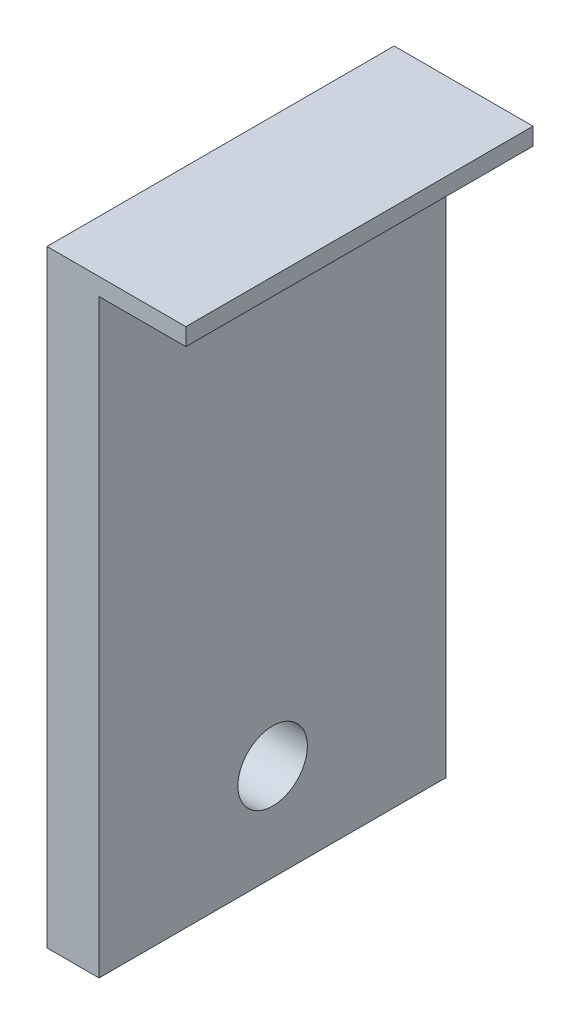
ISO-10303-21;
HEADER;
FILE_DESCRIPTION(('STEP AP214'),'2;1');
FILE_NAME('part.step','',(''),(''),'','','');
FILE_SCHEMA(('AUTOMOTIVE_DESIGN { 1 0 10303 214 1 1 1 1 }'));
ENDSEC;
DATA;
#1=APPLICATION_CONTEXT('core data for automotive mechanical design processes');
#2=APPLICATION_PROTOCOL_DEFINITION('international standard','automotive_design',2000,#1);
#3=PRODUCT_CONTEXT('',#1,'mechanical');
#4=PRODUCT('Part','Part','',(#3));
#5=PRODUCT_RELATED_PRODUCT_CATEGORY('part','',(#4));
#6=PRODUCT_DEFINITION_FORMATION('','',#4);
#7=PRODUCT_DEFINITION_CONTEXT('part definition',#1,'design');
#8=PRODUCT_DEFINITION('design','',#6,#7);
#9=PRODUCT_DEFINITION_SHAPE('','',#8);
#10=(LENGTH_UNIT() NAMED_UNIT(*) SI_UNIT(.MILLI.,.METRE.));
#11=(NAMED_UNIT(*) PLANE_ANGLE_UNIT() SI_UNIT($,.RADIAN.));
#12=(NAMED_UNIT(*) SI_UNIT($,.STERADIAN.) SOLID_ANGLE_UNIT());
#13=UNCERTAINTY_MEASURE_WITH_UNIT(LENGTH_MEASURE(1.E-05),#10,'distance_accuracy_value','');
#14=(GEOMETRIC_REPRESENTATION_CONTEXT(3) GLOBAL_UNCERTAINTY_ASSIGNED_CONTEXT((#13)) GLOBAL_UNIT_ASSIGNED_CONTEXT((#10,
#11,#12)) REPRESENTATION_CONTEXT('',''));
#15=CARTESIAN_POINT('',(0.,0.,0.));
#16=DIRECTION('',(0.,0.,1.));
#17=DIRECTION('',(1.,0.,0.));
#18=AXIS2_PLACEMENT_3D('',#15,#16,#17);
#19=CARTESIAN_POINT('',(3.,35.,0.));
#20=DIRECTION('',(-1.,0.,0.));
#21=DIRECTION('',(0.,0.,1.));
#22=AXIS2_PLACEMENT_3D('',#19,#20,#21);
#23=PLANE('',#22);
#24=CARTESIAN_POINT('',(3.,5.57985377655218,-10.));
#25=DIRECTION('',(-1.,0.,0.));
#26=DIRECTION('',(0.,0.,1.));
#27=AXIS2_PLACEMENT_3D('',#24,#25,#26);
#28=CIRCLE('',#27,2.);
#29=CARTESIAN_POINT('',(3.,5.57985377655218,-8.));
#30=VERTEX_POINT('',#29);
#31=EDGE_CURVE('E126',#30,#30,#28,.T.);
#32=ORIENTED_EDGE('',*,*,#31,.T.);
#33=EDGE_LOOP('',(#32));
#34=FACE_BOUND('',#33,.T.);
#35=DIRECTION('',(0.,0.,-1.));
#36=VECTOR('',#35,1.);
#37=CARTESIAN_POINT('',(3.,34.,0.));
#38=LINE('',#37,#36);
#39=CARTESIAN_POINT('',(3.,34.,0.));
#40=VERTEX_POINT('',#39);
#41=CARTESIAN_POINT('',(3.,34.,-20.));
#42=VERTEX_POINT('',#41);
#43=EDGE_CURVE('E52',#40,#42,#38,.T.);
#44=ORIENTED_EDGE('',*,*,#43,.F.);
#45=DIRECTION('',(0.,-1.,0.));
#46=VECTOR('',#45,1.);
#47=CARTESIAN_POINT('',(3.,35.,0.));
#48=LINE('',#47,#46);
#49=CARTESIAN_POINT('',(3.,0.,0.));
#50=VERTEX_POINT('',#49);
#51=EDGE_CURVE('E45',#40,#50,#48,.T.);
#52=ORIENTED_EDGE('',*,*,#51,.T.);
#53=DIRECTION('',(0.,0.,-1.));
#54=VECTOR('',#53,1.);
#55=CARTESIAN_POINT('',(3.,0.,0.));
#56=LINE('',#55,#54);
#57=CARTESIAN_POINT('',(3.,0.,-20.));
#58=VERTEX_POINT('',#57);
#59=EDGE_CURVE('E91',#50,#58,#56,.T.);
#60=ORIENTED_EDGE('',*,*,#59,.T.);
#61=DIRECTION('',(0.,-1.,0.));
#62=VECTOR('',#61,1.);
#63=CARTESIAN_POINT('',(3.,35.,-20.));
#64=LINE('',#63,#62);
#65=EDGE_CURVE('E85',#42,#58,#64,.T.);
#66=ORIENTED_EDGE('',*,*,#65,.F.);
#67=EDGE_LOOP('',(#44,#52,#60,#66));
#68=FACE_BOUND('',#67,.T.);
#69=ADVANCED_FACE('F37',(#34,#68),#23,.F.);
#70=CARTESIAN_POINT('',(0.,35.,0.));
#71=DIRECTION('',(1.,0.,0.));
#72=DIRECTION('',(0.,0.,-1.));
#73=AXIS2_PLACEMENT_3D('',#70,#71,#72);
#74=PLANE('',#73);
#75=CARTESIAN_POINT('',(0.,5.57985377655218,-10.));
#76=DIRECTION('',(-1.,0.,0.));
#77=DIRECTION('',(0.,0.,1.));
#78=AXIS2_PLACEMENT_3D('',#75,#76,#77);
#79=CIRCLE('',#78,2.);
#80=CARTESIAN_POINT('',(0.,5.57985377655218,-8.));
#81=VERTEX_POINT('',#80);
#82=EDGE_CURVE('E137',#81,#81,#79,.T.);
#83=ORIENTED_EDGE('',*,*,#82,.F.);
#84=EDGE_LOOP('',(#83));
#85=FACE_BOUND('',#84,.T.);
#86=DIRECTION('',(0.,0.,1.));
#87=VECTOR('',#86,1.);
#88=CARTESIAN_POINT('',(0.,0.,0.));
#89=LINE('',#88,#87);
#90=CARTESIAN_POINT('',(0.,0.,-20.));
#91=VERTEX_POINT('',#90);
#92=CARTESIAN_POINT('',(0.,0.,0.));
#93=VERTEX_POINT('',#92);
#94=EDGE_CURVE('E96',#91,#93,#89,.T.);
#95=ORIENTED_EDGE('',*,*,#94,.T.);
#96=DIRECTION('',(0.,-1.,0.));
#97=VECTOR('',#96,1.);
#98=CARTESIAN_POINT('',(0.,35.,0.));
#99=LINE('',#98,#97);
#100=CARTESIAN_POINT('',(0.,35.,0.));
#101=VERTEX_POINT('',#100);
#102=EDGE_CURVE('E11',#101,#93,#99,.T.);
#103=ORIENTED_EDGE('',*,*,#102,.F.);
#104=DIRECTION('',(0.,0.,1.));
#105=VECTOR('',#104,1.);
#106=CARTESIAN_POINT('',(0.,35.,0.));
#107=LINE('',#106,#105);
#108=CARTESIAN_POINT('',(0.,35.,-20.));
#109=VERTEX_POINT('',#108);
#110=EDGE_CURVE('E90',#109,#101,#107,.T.);
#111=ORIENTED_EDGE('',*,*,#110,.F.);
#112=DIRECTION('',(0.,-1.,0.));
#113=VECTOR('',#112,1.);
#114=CARTESIAN_POINT('',(0.,35.,-20.));
#115=LINE('',#114,#113);
#116=EDGE_CURVE('E82',#109,#91,#115,.T.);
#117=ORIENTED_EDGE('',*,*,#116,.T.);
#118=EDGE_LOOP('',(#95,#103,#111,#117));
#119=FACE_BOUND('',#118,.T.);
#120=ADVANCED_FACE('F39',(#85,#119),#74,.F.);
#121=CARTESIAN_POINT('',(0.,35.,0.));
#122=DIRECTION('',(0.,0.,-1.));
#123=DIRECTION('',(-1.,0.,0.));
#124=AXIS2_PLACEMENT_3D('',#121,#122,#123);
#125=PLANE('',#124);
#126=DIRECTION('',(1.,0.,0.));
#127=VECTOR('',#126,1.);
#128=CARTESIAN_POINT('',(0.,0.,0.));
#129=LINE('',#128,#127);
#130=EDGE_CURVE('E100',#93,#50,#129,.T.);
#131=ORIENTED_EDGE('',*,*,#130,.T.);
#132=ORIENTED_EDGE('',*,*,#51,.F.);
#133=DIRECTION('',(-1.,0.,0.));
#134=VECTOR('',#133,1.);
#135=CARTESIAN_POINT('',(8.,34.,0.));
#136=LINE('',#135,#134);
#137=CARTESIAN_POINT('',(8.,34.,0.));
#138=VERTEX_POINT('',#137);
#139=EDGE_CURVE('E101',#138,#40,#136,.T.);
#140=ORIENTED_EDGE('',*,*,#139,.F.);
#141=DIRECTION('',(0.,-1.,0.));
#142=VECTOR('',#141,1.);
#143=CARTESIAN_POINT('',(8.,35.,0.));
#144=LINE('',#143,#142);
#145=CARTESIAN_POINT('',(8.,35.,0.));
#146=VERTEX_POINT('',#145);
#147=EDGE_CURVE('E118',#146,#138,#144,.T.);
#148=ORIENTED_EDGE('',*,*,#147,.F.);
#149=DIRECTION('',(1.,0.,0.));
#150=VECTOR('',#149,1.);
#151=CARTESIAN_POINT('',(0.,35.,0.));
#152=LINE('',#151,#150);
#153=EDGE_CURVE('E116',#101,#146,#152,.T.);
#154=ORIENTED_EDGE('',*,*,#153,.F.);
#155=ORIENTED_EDGE('',*,*,#102,.T.);
#156=EDGE_LOOP('',(#131,#132,#140,#148,#154,#155));
#157=FACE_BOUND('',#156,.T.);
#158=ADVANCED_FACE('F113',(#157),#125,.F.);
#159=CARTESIAN_POINT('',(0.,35.,-20.));
#160=DIRECTION('',(0.,0.,1.));
#161=DIRECTION('',(1.,0.,0.));
#162=AXIS2_PLACEMENT_3D('',#159,#160,#161);
#163=PLANE('',#162);
#164=DIRECTION('',(-1.,0.,0.));
#165=VECTOR('',#164,1.);
#166=CARTESIAN_POINT('',(0.,0.,-20.));
#167=LINE('',#166,#165);
#168=EDGE_CURVE('E79',#58,#91,#167,.T.);
#169=ORIENTED_EDGE('',*,*,#168,.T.);
#170=ORIENTED_EDGE('',*,*,#116,.F.);
#171=DIRECTION('',(-1.,0.,0.));
#172=VECTOR('',#171,1.);
#173=CARTESIAN_POINT('',(0.,35.,-20.));
#174=LINE('',#173,#172);
#175=CARTESIAN_POINT('',(8.,35.,-20.));
#176=VERTEX_POINT('',#175);
#177=EDGE_CURVE('E61',#176,#109,#174,.T.);
#178=ORIENTED_EDGE('',*,*,#177,.F.);
#179=DIRECTION('',(0.,1.,0.));
#180=VECTOR('',#179,1.);
#181=CARTESIAN_POINT('',(8.,35.,-20.));
#182=LINE('',#181,#180);
#183=CARTESIAN_POINT('',(8.,34.,-20.));
#184=VERTEX_POINT('',#183);
#185=EDGE_CURVE('E128',#184,#176,#182,.T.);
#186=ORIENTED_EDGE('',*,*,#185,.F.);
#187=DIRECTION('',(-1.,0.,0.));
#188=VECTOR('',#187,1.);
#189=CARTESIAN_POINT('',(8.,34.,-20.));
#190=LINE('',#189,#188);
#191=EDGE_CURVE('E105',#184,#42,#190,.T.);
#192=ORIENTED_EDGE('',*,*,#191,.T.);
#193=ORIENTED_EDGE('',*,*,#65,.T.);
#194=EDGE_LOOP('',(#169,#170,#178,#186,#192,#193));
#195=FACE_BOUND('',#194,.T.);
#196=ADVANCED_FACE('F81',(#195),#163,.F.);
#197=CARTESIAN_POINT('',(0.,35.,0.));
#198=DIRECTION('',(0.,-1.,0.));
#199=DIRECTION('',(0.,0.,-1.));
#200=AXIS2_PLACEMENT_3D('',#197,#198,#199);
#201=PLANE('',#200);
#202=ORIENTED_EDGE('',*,*,#110,.T.);
#203=ORIENTED_EDGE('',*,*,#153,.T.);
#204=DIRECTION('',(0.,0.,1.));
#205=VECTOR('',#204,1.);
#206=CARTESIAN_POINT('',(8.,35.,0.));
#207=LINE('',#206,#205);
#208=EDGE_CURVE('E124',#176,#146,#207,.T.);
#209=ORIENTED_EDGE('',*,*,#208,.F.);
#210=ORIENTED_EDGE('',*,*,#177,.T.);
#211=EDGE_LOOP('',(#202,#203,#209,#210));
#212=FACE_BOUND('',#211,.T.);
#213=ADVANCED_FACE('F120',(#212),#201,.F.);
#214=CARTESIAN_POINT('',(0.,0.,0.));
#215=DIRECTION('',(0.,-1.,0.));
#216=DIRECTION('',(0.,0.,-1.));
#217=AXIS2_PLACEMENT_3D('',#214,#215,#216);
#218=PLANE('',#217);
#219=ORIENTED_EDGE('',*,*,#94,.F.);
#220=ORIENTED_EDGE('',*,*,#168,.F.);
#221=ORIENTED_EDGE('',*,*,#59,.F.);
#222=ORIENTED_EDGE('',*,*,#130,.F.);
#223=EDGE_LOOP('',(#219,#220,#221,#222));
#224=FACE_BOUND('',#223,.T.);
#225=ADVANCED_FACE('F98',(#224),#218,.T.);
#226=CARTESIAN_POINT('',(8.,34.,0.));
#227=DIRECTION('',(0.,1.,0.));
#228=DIRECTION('',(0.,0.,1.));
#229=AXIS2_PLACEMENT_3D('',#226,#227,#228);
#230=PLANE('',#229);
#231=ORIENTED_EDGE('',*,*,#43,.T.);
#232=ORIENTED_EDGE('',*,*,#191,.F.);
#233=DIRECTION('',(0.,0.,-1.));
#234=VECTOR('',#233,1.);
#235=CARTESIAN_POINT('',(8.,34.,0.));
#236=LINE('',#235,#234);
#237=EDGE_CURVE('E131',#138,#184,#236,.T.);
#238=ORIENTED_EDGE('',*,*,#237,.F.);
#239=ORIENTED_EDGE('',*,*,#139,.T.);
#240=EDGE_LOOP('',(#231,#232,#238,#239));
#241=FACE_BOUND('',#240,.T.);
#242=ADVANCED_FACE('F158',(#241),#230,.F.);
#243=CARTESIAN_POINT('',(8.,0.,0.));
#244=DIRECTION('',(1.,0.,0.));
#245=DIRECTION('',(0.,0.,-1.));
#246=AXIS2_PLACEMENT_3D('',#243,#244,#245);
#247=PLANE('',#246);
#248=ORIENTED_EDGE('',*,*,#147,.T.);
#249=ORIENTED_EDGE('',*,*,#237,.T.);
#250=ORIENTED_EDGE('',*,*,#185,.T.);
#251=ORIENTED_EDGE('',*,*,#208,.T.);
#252=EDGE_LOOP('',(#248,#249,#250,#251));
#253=FACE_BOUND('',#252,.T.);
#254=ADVANCED_FACE('F163',(#253),#247,.T.);
#255=CARTESIAN_POINT('',(5.,5.57985377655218,-10.));
#256=DIRECTION('',(-1.,0.,0.));
#257=DIRECTION('',(0.,0.,1.));
#258=AXIS2_PLACEMENT_3D('',#255,#256,#257);
#259=CYLINDRICAL_SURFACE('',#258,2.);
#260=ORIENTED_EDGE('',*,*,#82,.T.);
#261=EDGE_LOOP('',(#260));
#262=FACE_BOUND('',#261,.T.);
#263=ORIENTED_EDGE('',*,*,#31,.F.);
#264=EDGE_LOOP('',(#263));
#265=FACE_BOUND('',#264,.T.);
#266=ADVANCED_FACE('F141',(#262,#265),#259,.F.);
#267=CLOSED_SHELL('',(#69,#120,#158,#196,#213,#225,#242,#254,#266));
#268=MANIFOLD_SOLID_BREP('B2',#267);
#269=ADVANCED_BREP_SHAPE_REPRESENTATION('',(#18,#268),#14);
#270=SHAPE_DEFINITION_REPRESENTATION(#9,#269);
ENDSEC;
END-ISO-10303-21;
